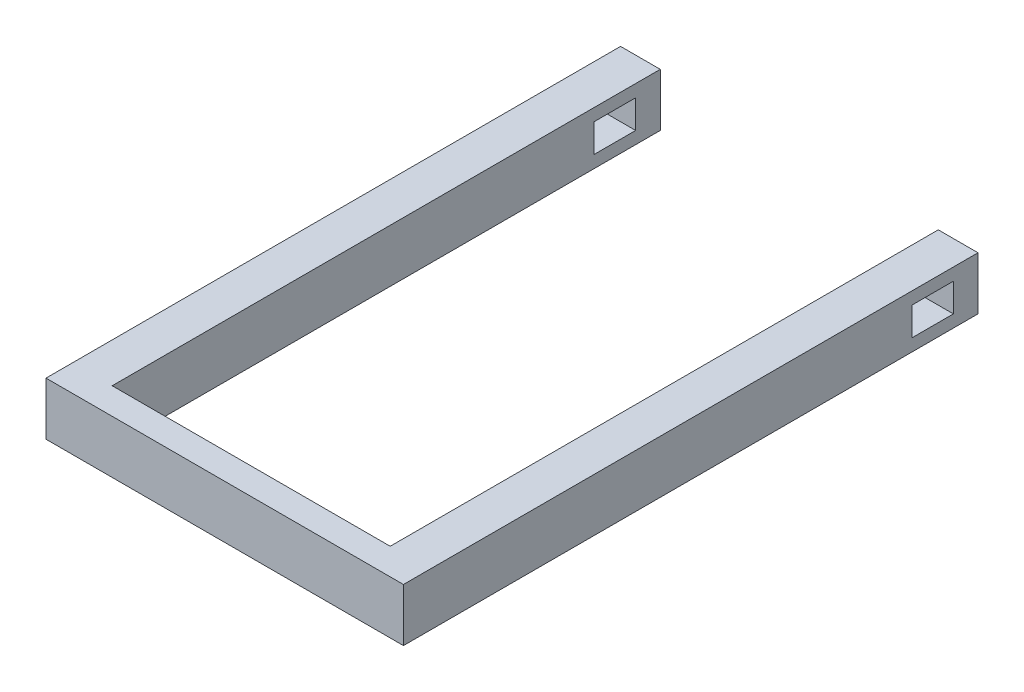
ISO-10303-21;
HEADER;
FILE_DESCRIPTION(('STEP AP214'),'2;1');
FILE_NAME('part.step','',(''),(''),'','','');
FILE_SCHEMA(('AUTOMOTIVE_DESIGN { 1 0 10303 214 1 1 1 1 }'));
ENDSEC;
DATA;
#1=APPLICATION_CONTEXT('core data for automotive mechanical design processes');
#2=APPLICATION_PROTOCOL_DEFINITION('international standard','automotive_design',2000,#1);
#3=PRODUCT_CONTEXT('',#1,'mechanical');
#4=PRODUCT('Part','Part','',(#3));
#5=PRODUCT_RELATED_PRODUCT_CATEGORY('part','',(#4));
#6=PRODUCT_DEFINITION_FORMATION('','',#4);
#7=PRODUCT_DEFINITION_CONTEXT('part definition',#1,'design');
#8=PRODUCT_DEFINITION('design','',#6,#7);
#9=PRODUCT_DEFINITION_SHAPE('','',#8);
#10=(LENGTH_UNIT() NAMED_UNIT(*) SI_UNIT(.MILLI.,.METRE.));
#11=(NAMED_UNIT(*) PLANE_ANGLE_UNIT() SI_UNIT($,.RADIAN.));
#12=(NAMED_UNIT(*) SI_UNIT($,.STERADIAN.) SOLID_ANGLE_UNIT());
#13=UNCERTAINTY_MEASURE_WITH_UNIT(LENGTH_MEASURE(1.E-05),#10,'distance_accuracy_value','');
#14=(GEOMETRIC_REPRESENTATION_CONTEXT(3) GLOBAL_UNCERTAINTY_ASSIGNED_CONTEXT((#13)) GLOBAL_UNIT_ASSIGNED_CONTEXT((#10,
#11,#12)) REPRESENTATION_CONTEXT('',''));
#15=CARTESIAN_POINT('',(0.,0.,0.));
#16=DIRECTION('',(0.,0.,1.));
#17=DIRECTION('',(1.,0.,0.));
#18=AXIS2_PLACEMENT_3D('',#15,#16,#17);
#19=CARTESIAN_POINT('',(-10.5,4.,-43.4));
#20=DIRECTION('',(0.,0.,1.));
#21=DIRECTION('',(1.,0.,0.));
#22=AXIS2_PLACEMENT_3D('',#19,#20,#21);
#23=PLANE('',#22);
#24=DIRECTION('',(-1.,0.,0.));
#25=VECTOR('',#24,1.);
#26=CARTESIAN_POINT('',(-10.5,0.,-43.4));
#27=LINE('',#26,#25);
#28=CARTESIAN_POINT('',(-10.5,0.,-43.4));
#29=VERTEX_POINT('',#28);
#30=CARTESIAN_POINT('',(-13.5,0.,-43.4));
#31=VERTEX_POINT('',#30);
#32=EDGE_CURVE('E232',#29,#31,#27,.T.);
#33=ORIENTED_EDGE('',*,*,#32,.T.);
#34=DIRECTION('',(0.,-1.,0.));
#35=VECTOR('',#34,1.);
#36=CARTESIAN_POINT('',(-13.5,4.,-43.4));
#37=LINE('',#36,#35);
#38=CARTESIAN_POINT('',(-13.5,4.,-43.4));
#39=VERTEX_POINT('',#38);
#40=EDGE_CURVE('E310',#39,#31,#37,.T.);
#41=ORIENTED_EDGE('',*,*,#40,.F.);
#42=DIRECTION('',(-1.,0.,0.));
#43=VECTOR('',#42,1.);
#44=CARTESIAN_POINT('',(-10.5,4.,-43.4));
#45=LINE('',#44,#43);
#46=CARTESIAN_POINT('',(-10.5,4.,-43.4));
#47=VERTEX_POINT('',#46);
#48=EDGE_CURVE('E233',#47,#39,#45,.T.);
#49=ORIENTED_EDGE('',*,*,#48,.F.);
#50=DIRECTION('',(0.,-1.,0.));
#51=VECTOR('',#50,1.);
#52=CARTESIAN_POINT('',(-10.5,4.,-43.4));
#53=LINE('',#52,#51);
#54=EDGE_CURVE('E259',#47,#29,#53,.T.);
#55=ORIENTED_EDGE('',*,*,#54,.T.);
#56=EDGE_LOOP('',(#33,#41,#49,#55));
#57=FACE_BOUND('',#56,.T.);
#58=ADVANCED_FACE('F45',(#57),#23,.F.);
#59=CARTESIAN_POINT('',(-13.5,4.,-43.4));
#60=DIRECTION('',(1.,0.,0.));
#61=DIRECTION('',(0.,0.,-1.));
#62=AXIS2_PLACEMENT_3D('',#59,#60,#61);
#63=PLANE('',#62);
#64=DIRECTION('',(0.,0.,1.));
#65=VECTOR('',#64,1.);
#66=CARTESIAN_POINT('',(-13.5,3.07,-38.4));
#67=LINE('',#66,#65);
#68=CARTESIAN_POINT('',(-13.5,3.07,-41.54));
#69=VERTEX_POINT('',#68);
#70=CARTESIAN_POINT('',(-13.5,3.07,-38.4));
#71=VERTEX_POINT('',#70);
#72=EDGE_CURVE('E183',#69,#71,#67,.T.);
#73=ORIENTED_EDGE('',*,*,#72,.T.);
#74=DIRECTION('',(0.,-1.,0.));
#75=VECTOR('',#74,1.);
#76=CARTESIAN_POINT('',(-13.5,3.07,-38.4));
#77=LINE('',#76,#75);
#78=CARTESIAN_POINT('',(-13.5,0.929999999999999,-38.4));
#79=VERTEX_POINT('',#78);
#80=EDGE_CURVE('E165',#71,#79,#77,.T.);
#81=ORIENTED_EDGE('',*,*,#80,.T.);
#82=DIRECTION('',(0.,0.,-1.));
#83=VECTOR('',#82,1.);
#84=CARTESIAN_POINT('',(-13.5,0.929999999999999,-38.4));
#85=LINE('',#84,#83);
#86=CARTESIAN_POINT('',(-13.5,0.93,-41.54));
#87=VERTEX_POINT('',#86);
#88=EDGE_CURVE('E174',#79,#87,#85,.T.);
#89=ORIENTED_EDGE('',*,*,#88,.T.);
#90=DIRECTION('',(0.,1.,0.));
#91=VECTOR('',#90,1.);
#92=CARTESIAN_POINT('',(-13.5,3.07,-41.54));
#93=LINE('',#92,#91);
#94=EDGE_CURVE('E60',#87,#69,#93,.T.);
#95=ORIENTED_EDGE('',*,*,#94,.T.);
#96=EDGE_LOOP('',(#73,#81,#89,#95));
#97=FACE_BOUND('',#96,.T.);
#98=DIRECTION('',(0.,0.,1.));
#99=VECTOR('',#98,1.);
#100=CARTESIAN_POINT('',(-13.5,0.,-43.4));
#101=LINE('',#100,#99);
#102=CARTESIAN_POINT('',(-13.5,0.,0.));
#103=VERTEX_POINT('',#102);
#104=EDGE_CURVE('E263',#31,#103,#101,.T.);
#105=ORIENTED_EDGE('',*,*,#104,.T.);
#106=DIRECTION('',(0.,-1.,0.));
#107=VECTOR('',#106,1.);
#108=CARTESIAN_POINT('',(-13.5,4.,0.));
#109=LINE('',#108,#107);
#110=CARTESIAN_POINT('',(-13.5,4.,0.));
#111=VERTEX_POINT('',#110);
#112=EDGE_CURVE('E306',#111,#103,#109,.T.);
#113=ORIENTED_EDGE('',*,*,#112,.F.);
#114=DIRECTION('',(0.,0.,1.));
#115=VECTOR('',#114,1.);
#116=CARTESIAN_POINT('',(-13.5,4.,-43.4));
#117=LINE('',#116,#115);
#118=EDGE_CURVE('E237',#39,#111,#117,.T.);
#119=ORIENTED_EDGE('',*,*,#118,.F.);
#120=ORIENTED_EDGE('',*,*,#40,.T.);
#121=EDGE_LOOP('',(#105,#113,#119,#120));
#122=FACE_BOUND('',#121,.T.);
#123=ADVANCED_FACE('F180',(#97,#122),#63,.F.);
#124=CARTESIAN_POINT('',(-13.5,4.,0.));
#125=DIRECTION('',(0.,0.,-1.));
#126=DIRECTION('',(-1.,0.,0.));
#127=AXIS2_PLACEMENT_3D('',#124,#125,#126);
#128=PLANE('',#127);
#129=DIRECTION('',(1.,0.,0.));
#130=VECTOR('',#129,1.);
#131=CARTESIAN_POINT('',(-13.5,0.,0.));
#132=LINE('',#131,#130);
#133=CARTESIAN_POINT('',(13.5,0.,0.));
#134=VERTEX_POINT('',#133);
#135=EDGE_CURVE('E266',#103,#134,#132,.T.);
#136=ORIENTED_EDGE('',*,*,#135,.T.);
#137=DIRECTION('',(0.,-1.,0.));
#138=VECTOR('',#137,1.);
#139=CARTESIAN_POINT('',(13.5,4.,0.));
#140=LINE('',#139,#138);
#141=CARTESIAN_POINT('',(13.5,4.,0.));
#142=VERTEX_POINT('',#141);
#143=EDGE_CURVE('E302',#142,#134,#140,.T.);
#144=ORIENTED_EDGE('',*,*,#143,.F.);
#145=DIRECTION('',(1.,0.,0.));
#146=VECTOR('',#145,1.);
#147=CARTESIAN_POINT('',(-13.5,4.,0.));
#148=LINE('',#147,#146);
#149=EDGE_CURVE('E241',#111,#142,#148,.T.);
#150=ORIENTED_EDGE('',*,*,#149,.F.);
#151=ORIENTED_EDGE('',*,*,#112,.T.);
#152=EDGE_LOOP('',(#136,#144,#150,#151));
#153=FACE_BOUND('',#152,.T.);
#154=ADVANCED_FACE('F348',(#153),#128,.F.);
#155=CARTESIAN_POINT('',(13.5,4.,0.));
#156=DIRECTION('',(-1.,0.,0.));
#157=DIRECTION('',(0.,0.,1.));
#158=AXIS2_PLACEMENT_3D('',#155,#156,#157);
#159=PLANE('',#158);
#160=DIRECTION('',(0.,0.,-1.));
#161=VECTOR('',#160,1.);
#162=CARTESIAN_POINT('',(13.5,0.929999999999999,-38.4));
#163=LINE('',#162,#161);
#164=CARTESIAN_POINT('',(13.5,0.93,-38.4));
#165=VERTEX_POINT('',#164);
#166=CARTESIAN_POINT('',(13.5,0.93,-41.54));
#167=VERTEX_POINT('',#166);
#168=EDGE_CURVE('E198',#165,#167,#163,.T.);
#169=ORIENTED_EDGE('',*,*,#168,.F.);
#170=DIRECTION('',(0.,-1.,0.));
#171=VECTOR('',#170,1.);
#172=CARTESIAN_POINT('',(13.5,3.07,-38.4));
#173=LINE('',#172,#171);
#174=CARTESIAN_POINT('',(13.5,3.07,-38.4));
#175=VERTEX_POINT('',#174);
#176=EDGE_CURVE('E68',#175,#165,#173,.T.);
#177=ORIENTED_EDGE('',*,*,#176,.F.);
#178=DIRECTION('',(0.,0.,1.));
#179=VECTOR('',#178,1.);
#180=CARTESIAN_POINT('',(13.5,3.07,-38.4));
#181=LINE('',#180,#179);
#182=CARTESIAN_POINT('',(13.5,3.07,-41.54));
#183=VERTEX_POINT('',#182);
#184=EDGE_CURVE('E185',#183,#175,#181,.T.);
#185=ORIENTED_EDGE('',*,*,#184,.F.);
#186=DIRECTION('',(0.,1.,0.));
#187=VECTOR('',#186,1.);
#188=CARTESIAN_POINT('',(13.5,3.07,-41.54));
#189=LINE('',#188,#187);
#190=EDGE_CURVE('E189',#167,#183,#189,.T.);
#191=ORIENTED_EDGE('',*,*,#190,.F.);
#192=EDGE_LOOP('',(#169,#177,#185,#191));
#193=FACE_BOUND('',#192,.T.);
#194=DIRECTION('',(0.,0.,-1.));
#195=VECTOR('',#194,1.);
#196=CARTESIAN_POINT('',(13.5,0.,0.));
#197=LINE('',#196,#195);
#198=CARTESIAN_POINT('',(13.5,0.,-43.4));
#199=VERTEX_POINT('',#198);
#200=EDGE_CURVE('E269',#134,#199,#197,.T.);
#201=ORIENTED_EDGE('',*,*,#200,.T.);
#202=DIRECTION('',(0.,-1.,0.));
#203=VECTOR('',#202,1.);
#204=CARTESIAN_POINT('',(13.5,4.,-43.4));
#205=LINE('',#204,#203);
#206=CARTESIAN_POINT('',(13.5,4.,-43.4));
#207=VERTEX_POINT('',#206);
#208=EDGE_CURVE('E298',#207,#199,#205,.T.);
#209=ORIENTED_EDGE('',*,*,#208,.F.);
#210=DIRECTION('',(0.,0.,-1.));
#211=VECTOR('',#210,1.);
#212=CARTESIAN_POINT('',(13.5,4.,0.));
#213=LINE('',#212,#211);
#214=EDGE_CURVE('E244',#142,#207,#213,.T.);
#215=ORIENTED_EDGE('',*,*,#214,.F.);
#216=ORIENTED_EDGE('',*,*,#143,.T.);
#217=EDGE_LOOP('',(#201,#209,#215,#216));
#218=FACE_BOUND('',#217,.T.);
#219=ADVANCED_FACE('F380',(#193,#218),#159,.F.);
#220=CARTESIAN_POINT('',(13.5,4.,-43.4));
#221=DIRECTION('',(0.,0.,1.));
#222=DIRECTION('',(1.,0.,0.));
#223=AXIS2_PLACEMENT_3D('',#220,#221,#222);
#224=PLANE('',#223);
#225=DIRECTION('',(-1.,0.,0.));
#226=VECTOR('',#225,1.);
#227=CARTESIAN_POINT('',(13.5,0.,-43.4));
#228=LINE('',#227,#226);
#229=CARTESIAN_POINT('',(10.5,0.,-43.4));
#230=VERTEX_POINT('',#229);
#231=EDGE_CURVE('E272',#199,#230,#228,.T.);
#232=ORIENTED_EDGE('',*,*,#231,.T.);
#233=DIRECTION('',(0.,-1.,0.));
#234=VECTOR('',#233,1.);
#235=CARTESIAN_POINT('',(10.5,4.,-43.4));
#236=LINE('',#235,#234);
#237=CARTESIAN_POINT('',(10.5,4.,-43.4));
#238=VERTEX_POINT('',#237);
#239=EDGE_CURVE('E294',#238,#230,#236,.T.);
#240=ORIENTED_EDGE('',*,*,#239,.F.);
#241=DIRECTION('',(-1.,0.,0.));
#242=VECTOR('',#241,1.);
#243=CARTESIAN_POINT('',(13.5,4.,-43.4));
#244=LINE('',#243,#242);
#245=EDGE_CURVE('E247',#207,#238,#244,.T.);
#246=ORIENTED_EDGE('',*,*,#245,.F.);
#247=ORIENTED_EDGE('',*,*,#208,.T.);
#248=EDGE_LOOP('',(#232,#240,#246,#247));
#249=FACE_BOUND('',#248,.T.);
#250=ADVANCED_FACE('F376',(#249),#224,.F.);
#251=CARTESIAN_POINT('',(10.5,4.,-43.4));
#252=DIRECTION('',(1.,0.,0.));
#253=DIRECTION('',(0.,0.,-1.));
#254=AXIS2_PLACEMENT_3D('',#251,#252,#253);
#255=PLANE('',#254);
#256=DIRECTION('',(0.,0.,1.));
#257=VECTOR('',#256,1.);
#258=CARTESIAN_POINT('',(10.5,3.07,-43.4));
#259=LINE('',#258,#257);
#260=CARTESIAN_POINT('',(10.5,3.07,-41.54));
#261=VERTEX_POINT('',#260);
#262=CARTESIAN_POINT('',(10.5,3.07,-38.4));
#263=VERTEX_POINT('',#262);
#264=EDGE_CURVE('E224',#261,#263,#259,.T.);
#265=ORIENTED_EDGE('',*,*,#264,.T.);
#266=DIRECTION('',(0.,-1.,0.));
#267=VECTOR('',#266,1.);
#268=CARTESIAN_POINT('',(10.5,4.,-38.4));
#269=LINE('',#268,#267);
#270=CARTESIAN_POINT('',(10.5,0.929999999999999,-38.4));
#271=VERTEX_POINT('',#270);
#272=EDGE_CURVE('E228',#263,#271,#269,.T.);
#273=ORIENTED_EDGE('',*,*,#272,.T.);
#274=DIRECTION('',(0.,0.,-1.));
#275=VECTOR('',#274,1.);
#276=CARTESIAN_POINT('',(10.5,0.930000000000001,-43.4));
#277=LINE('',#276,#275);
#278=CARTESIAN_POINT('',(10.5,0.93,-41.54));
#279=VERTEX_POINT('',#278);
#280=EDGE_CURVE('E208',#271,#279,#277,.T.);
#281=ORIENTED_EDGE('',*,*,#280,.T.);
#282=DIRECTION('',(0.,1.,0.));
#283=VECTOR('',#282,1.);
#284=CARTESIAN_POINT('',(10.5,4.,-41.54));
#285=LINE('',#284,#283);
#286=EDGE_CURVE('E220',#279,#261,#285,.T.);
#287=ORIENTED_EDGE('',*,*,#286,.T.);
#288=EDGE_LOOP('',(#265,#273,#281,#287));
#289=FACE_BOUND('',#288,.T.);
#290=DIRECTION('',(0.,0.,1.));
#291=VECTOR('',#290,1.);
#292=CARTESIAN_POINT('',(10.5,0.,-43.4));
#293=LINE('',#292,#291);
#294=CARTESIAN_POINT('',(10.5,0.,-2.));
#295=VERTEX_POINT('',#294);
#296=EDGE_CURVE('E275',#230,#295,#293,.T.);
#297=ORIENTED_EDGE('',*,*,#296,.T.);
#298=DIRECTION('',(0.,-1.,0.));
#299=VECTOR('',#298,1.);
#300=CARTESIAN_POINT('',(10.5,4.,-2.));
#301=LINE('',#300,#299);
#302=CARTESIAN_POINT('',(10.5,4.,-2.));
#303=VERTEX_POINT('',#302);
#304=EDGE_CURVE('E290',#303,#295,#301,.T.);
#305=ORIENTED_EDGE('',*,*,#304,.F.);
#306=DIRECTION('',(0.,0.,1.));
#307=VECTOR('',#306,1.);
#308=CARTESIAN_POINT('',(10.5,4.,-43.4));
#309=LINE('',#308,#307);
#310=EDGE_CURVE('E250',#238,#303,#309,.T.);
#311=ORIENTED_EDGE('',*,*,#310,.F.);
#312=ORIENTED_EDGE('',*,*,#239,.T.);
#313=EDGE_LOOP('',(#297,#305,#311,#312));
#314=FACE_BOUND('',#313,.T.);
#315=ADVANCED_FACE('F371',(#289,#314),#255,.F.);
#316=CARTESIAN_POINT('',(10.5,4.,-2.));
#317=DIRECTION('',(0.,0.,1.));
#318=DIRECTION('',(1.,0.,0.));
#319=AXIS2_PLACEMENT_3D('',#316,#317,#318);
#320=PLANE('',#319);
#321=DIRECTION('',(-1.,0.,0.));
#322=VECTOR('',#321,1.);
#323=CARTESIAN_POINT('',(10.5,0.,-2.));
#324=LINE('',#323,#322);
#325=CARTESIAN_POINT('',(-10.5,0.,-2.));
#326=VERTEX_POINT('',#325);
#327=EDGE_CURVE('E278',#295,#326,#324,.T.);
#328=ORIENTED_EDGE('',*,*,#327,.T.);
#329=DIRECTION('',(0.,-1.,0.));
#330=VECTOR('',#329,1.);
#331=CARTESIAN_POINT('',(-10.5,4.,-2.));
#332=LINE('',#331,#330);
#333=CARTESIAN_POINT('',(-10.5,4.,-2.));
#334=VERTEX_POINT('',#333);
#335=EDGE_CURVE('E286',#334,#326,#332,.T.);
#336=ORIENTED_EDGE('',*,*,#335,.F.);
#337=DIRECTION('',(-1.,0.,0.));
#338=VECTOR('',#337,1.);
#339=CARTESIAN_POINT('',(10.5,4.,-2.));
#340=LINE('',#339,#338);
#341=EDGE_CURVE('E253',#303,#334,#340,.T.);
#342=ORIENTED_EDGE('',*,*,#341,.F.);
#343=ORIENTED_EDGE('',*,*,#304,.T.);
#344=EDGE_LOOP('',(#328,#336,#342,#343));
#345=FACE_BOUND('',#344,.T.);
#346=ADVANCED_FACE('F366',(#345),#320,.F.);
#347=CARTESIAN_POINT('',(-10.5,4.,-2.));
#348=DIRECTION('',(-1.,0.,0.));
#349=DIRECTION('',(0.,0.,1.));
#350=AXIS2_PLACEMENT_3D('',#347,#348,#349);
#351=PLANE('',#350);
#352=DIRECTION('',(0.,0.,1.));
#353=VECTOR('',#352,1.);
#354=CARTESIAN_POINT('',(-10.5,0.929999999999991,-2.));
#355=LINE('',#354,#353);
#356=CARTESIAN_POINT('',(-10.5,0.93,-41.54));
#357=VERTEX_POINT('',#356);
#358=CARTESIAN_POINT('',(-10.5,0.929999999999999,-38.4));
#359=VERTEX_POINT('',#358);
#360=EDGE_CURVE('E314',#357,#359,#355,.T.);
#361=ORIENTED_EDGE('',*,*,#360,.T.);
#362=DIRECTION('',(0.,1.,0.));
#363=VECTOR('',#362,1.);
#364=CARTESIAN_POINT('',(-10.5,4.,-38.4));
#365=LINE('',#364,#363);
#366=CARTESIAN_POINT('',(-10.5,3.07,-38.4));
#367=VERTEX_POINT('',#366);
#368=EDGE_CURVE('E11',#359,#367,#365,.T.);
#369=ORIENTED_EDGE('',*,*,#368,.T.);
#370=DIRECTION('',(0.,0.,-1.));
#371=VECTOR('',#370,1.);
#372=CARTESIAN_POINT('',(-10.5,3.07,-2.));
#373=LINE('',#372,#371);
#374=CARTESIAN_POINT('',(-10.5,3.07,-41.54));
#375=VERTEX_POINT('',#374);
#376=EDGE_CURVE('E53',#367,#375,#373,.T.);
#377=ORIENTED_EDGE('',*,*,#376,.T.);
#378=DIRECTION('',(0.,-1.,0.));
#379=VECTOR('',#378,1.);
#380=CARTESIAN_POINT('',(-10.5,4.,-41.54));
#381=LINE('',#380,#379);
#382=EDGE_CURVE('E317',#375,#357,#381,.T.);
#383=ORIENTED_EDGE('',*,*,#382,.T.);
#384=EDGE_LOOP('',(#361,#369,#377,#383));
#385=FACE_BOUND('',#384,.T.);
#386=DIRECTION('',(0.,0.,-1.));
#387=VECTOR('',#386,1.);
#388=CARTESIAN_POINT('',(-10.5,0.,-2.));
#389=LINE('',#388,#387);
#390=EDGE_CURVE('E238',#326,#29,#389,.T.);
#391=ORIENTED_EDGE('',*,*,#390,.T.);
#392=ORIENTED_EDGE('',*,*,#54,.F.);
#393=DIRECTION('',(0.,0.,-1.));
#394=VECTOR('',#393,1.);
#395=CARTESIAN_POINT('',(-10.5,4.,-2.));
#396=LINE('',#395,#394);
#397=EDGE_CURVE('E256',#334,#47,#396,.T.);
#398=ORIENTED_EDGE('',*,*,#397,.F.);
#399=ORIENTED_EDGE('',*,*,#335,.T.);
#400=EDGE_LOOP('',(#391,#392,#398,#399));
#401=FACE_BOUND('',#400,.T.);
#402=ADVANCED_FACE('F323',(#385,#401),#351,.F.);
#403=CARTESIAN_POINT('',(0.,4.,0.));
#404=DIRECTION('',(0.,1.,0.));
#405=DIRECTION('',(0.,0.,1.));
#406=AXIS2_PLACEMENT_3D('',#403,#404,#405);
#407=PLANE('',#406);
#408=ORIENTED_EDGE('',*,*,#48,.T.);
#409=ORIENTED_EDGE('',*,*,#118,.T.);
#410=ORIENTED_EDGE('',*,*,#149,.T.);
#411=ORIENTED_EDGE('',*,*,#214,.T.);
#412=ORIENTED_EDGE('',*,*,#245,.T.);
#413=ORIENTED_EDGE('',*,*,#310,.T.);
#414=ORIENTED_EDGE('',*,*,#341,.T.);
#415=ORIENTED_EDGE('',*,*,#397,.T.);
#416=EDGE_LOOP('',(#408,#409,#410,#411,#412,#413,#414,#415));
#417=FACE_BOUND('',#416,.T.);
#418=ADVANCED_FACE('F361',(#417),#407,.T.);
#419=CARTESIAN_POINT('',(0.,0.,0.));
#420=DIRECTION('',(0.,1.,0.));
#421=DIRECTION('',(0.,0.,1.));
#422=AXIS2_PLACEMENT_3D('',#419,#420,#421);
#423=PLANE('',#422);
#424=ORIENTED_EDGE('',*,*,#32,.F.);
#425=ORIENTED_EDGE('',*,*,#390,.F.);
#426=ORIENTED_EDGE('',*,*,#327,.F.);
#427=ORIENTED_EDGE('',*,*,#296,.F.);
#428=ORIENTED_EDGE('',*,*,#231,.F.);
#429=ORIENTED_EDGE('',*,*,#200,.F.);
#430=ORIENTED_EDGE('',*,*,#135,.F.);
#431=ORIENTED_EDGE('',*,*,#104,.F.);
#432=EDGE_LOOP('',(#424,#425,#426,#427,#428,#429,#430,#431));
#433=FACE_BOUND('',#432,.T.);
#434=ADVANCED_FACE('F337',(#433),#423,.F.);
#435=CARTESIAN_POINT('',(-13.5,0.929999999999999,-38.4));
#436=DIRECTION('',(0.,-1.,0.));
#437=DIRECTION('',(0.,0.,-1.));
#438=AXIS2_PLACEMENT_3D('',#435,#436,#437);
#439=PLANE('',#438);
#440=DIRECTION('',(1.,0.,0.));
#441=VECTOR('',#440,1.);
#442=CARTESIAN_POINT('',(-13.5,0.93,-41.54));
#443=LINE('',#442,#441);
#444=EDGE_CURVE('E176',#87,#357,#443,.T.);
#445=ORIENTED_EDGE('',*,*,#444,.F.);
#446=ORIENTED_EDGE('',*,*,#88,.F.);
#447=DIRECTION('',(1.,0.,0.));
#448=VECTOR('',#447,1.);
#449=CARTESIAN_POINT('',(-13.5,0.929999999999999,-38.4));
#450=LINE('',#449,#448);
#451=EDGE_CURVE('E160',#79,#359,#450,.T.);
#452=ORIENTED_EDGE('',*,*,#451,.T.);
#453=ORIENTED_EDGE('',*,*,#360,.F.);
#454=EDGE_LOOP('',(#445,#446,#452,#453));
#455=FACE_BOUND('',#454,.T.);
#456=ADVANCED_FACE('F175',(#455),#439,.F.);
#457=CARTESIAN_POINT('',(-13.5,3.07,-41.54));
#458=DIRECTION('',(0.,0.,-1.));
#459=DIRECTION('',(-1.,0.,0.));
#460=AXIS2_PLACEMENT_3D('',#457,#458,#459);
#461=PLANE('',#460);
#462=DIRECTION('',(1.,0.,0.));
#463=VECTOR('',#462,1.);
#464=CARTESIAN_POINT('',(-13.5,3.07,-41.54));
#465=LINE('',#464,#463);
#466=EDGE_CURVE('E210',#69,#375,#465,.T.);
#467=ORIENTED_EDGE('',*,*,#466,.F.);
#468=ORIENTED_EDGE('',*,*,#94,.F.);
#469=ORIENTED_EDGE('',*,*,#444,.T.);
#470=ORIENTED_EDGE('',*,*,#382,.F.);
#471=EDGE_LOOP('',(#467,#468,#469,#470));
#472=FACE_BOUND('',#471,.T.);
#473=ADVANCED_FACE('F327',(#472),#461,.F.);
#474=CARTESIAN_POINT('',(-13.5,3.07,-38.4));
#475=DIRECTION('',(0.,1.,0.));
#476=DIRECTION('',(0.,0.,1.));
#477=AXIS2_PLACEMENT_3D('',#474,#475,#476);
#478=PLANE('',#477);
#479=DIRECTION('',(1.,0.,0.));
#480=VECTOR('',#479,1.);
#481=CARTESIAN_POINT('',(-13.5,3.07,-38.4));
#482=LINE('',#481,#480);
#483=EDGE_CURVE('E205',#71,#367,#482,.T.);
#484=ORIENTED_EDGE('',*,*,#483,.F.);
#485=ORIENTED_EDGE('',*,*,#72,.F.);
#486=ORIENTED_EDGE('',*,*,#466,.T.);
#487=ORIENTED_EDGE('',*,*,#376,.F.);
#488=EDGE_LOOP('',(#484,#485,#486,#487));
#489=FACE_BOUND('',#488,.T.);
#490=ADVANCED_FACE('F326',(#489),#478,.F.);
#491=CARTESIAN_POINT('',(-13.5,3.07,-38.4));
#492=DIRECTION('',(0.,0.,1.));
#493=DIRECTION('',(1.,0.,0.));
#494=AXIS2_PLACEMENT_3D('',#491,#492,#493);
#495=PLANE('',#494);
#496=ORIENTED_EDGE('',*,*,#451,.F.);
#497=ORIENTED_EDGE('',*,*,#80,.F.);
#498=ORIENTED_EDGE('',*,*,#483,.T.);
#499=ORIENTED_EDGE('',*,*,#368,.F.);
#500=EDGE_LOOP('',(#496,#497,#498,#499));
#501=FACE_BOUND('',#500,.T.);
#502=ADVANCED_FACE('F162',(#501),#495,.F.);
#503=EDGE_CURVE('E209',#263,#175,#482,.T.);
#504=ORIENTED_EDGE('',*,*,#503,.T.);
#505=ORIENTED_EDGE('',*,*,#176,.T.);
#506=EDGE_CURVE('E171',#271,#165,#450,.T.);
#507=ORIENTED_EDGE('',*,*,#506,.F.);
#508=ORIENTED_EDGE('',*,*,#272,.F.);
#509=EDGE_LOOP('',(#504,#505,#507,#508));
#510=FACE_BOUND('',#509,.T.);
#511=ADVANCED_FACE('F403',(#510),#495,.F.);
#512=EDGE_CURVE('E214',#261,#183,#465,.T.);
#513=ORIENTED_EDGE('',*,*,#512,.T.);
#514=ORIENTED_EDGE('',*,*,#184,.T.);
#515=ORIENTED_EDGE('',*,*,#503,.F.);
#516=ORIENTED_EDGE('',*,*,#264,.F.);
#517=EDGE_LOOP('',(#513,#514,#515,#516));
#518=FACE_BOUND('',#517,.T.);
#519=ADVANCED_FACE('F336',(#518),#478,.F.);
#520=EDGE_CURVE('E170',#279,#167,#443,.T.);
#521=ORIENTED_EDGE('',*,*,#520,.T.);
#522=ORIENTED_EDGE('',*,*,#190,.T.);
#523=ORIENTED_EDGE('',*,*,#512,.F.);
#524=ORIENTED_EDGE('',*,*,#286,.F.);
#525=EDGE_LOOP('',(#521,#522,#523,#524));
#526=FACE_BOUND('',#525,.T.);
#527=ADVANCED_FACE('F330',(#526),#461,.F.);
#528=ORIENTED_EDGE('',*,*,#506,.T.);
#529=ORIENTED_EDGE('',*,*,#168,.T.);
#530=ORIENTED_EDGE('',*,*,#520,.F.);
#531=ORIENTED_EDGE('',*,*,#280,.F.);
#532=EDGE_LOOP('',(#528,#529,#530,#531));
#533=FACE_BOUND('',#532,.T.);
#534=ADVANCED_FACE('F339',(#533),#439,.F.);
#535=CLOSED_SHELL('',(#58,#123,#154,#219,#250,#315,#346,#402,#418,#434,#456,#473,#490,#502,#511,
#519,#527,#534));
#536=MANIFOLD_SOLID_BREP('B2',#535);
#537=ADVANCED_BREP_SHAPE_REPRESENTATION('',(#18,#536),#14);
#538=SHAPE_DEFINITION_REPRESENTATION(#9,#537);
ENDSEC;
END-ISO-10303-21;
